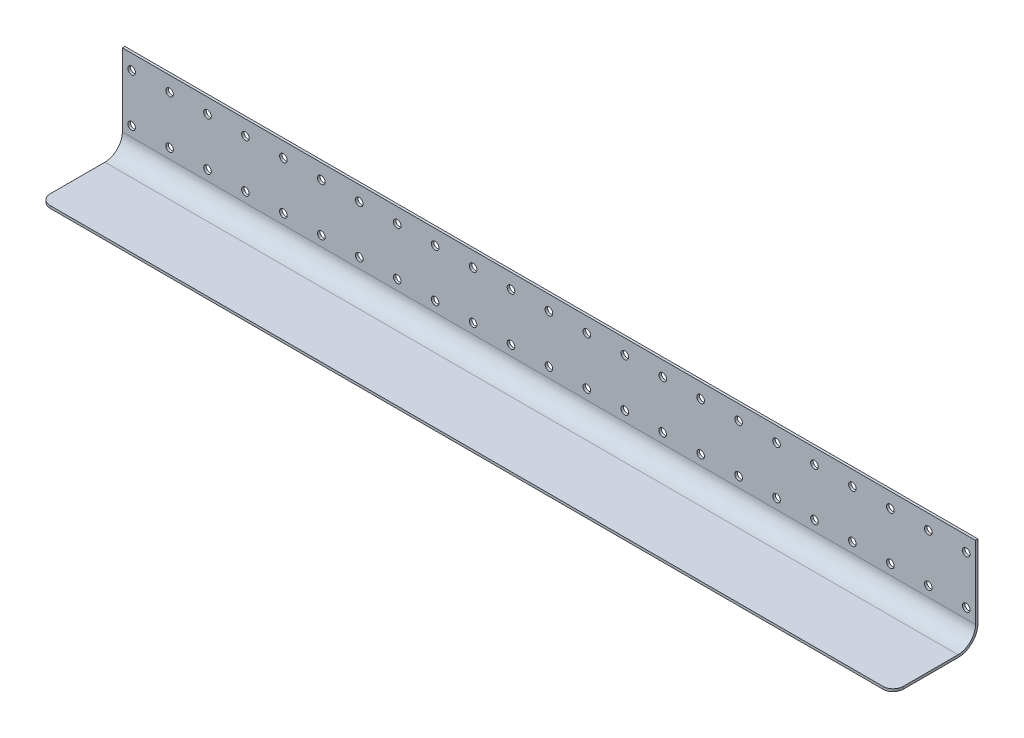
from build123d import *

# Parameters (mm, degrees)
MAIN_BODY_DEPTH         = 609.4222
UPPER_TABS_DEPTH        = 10
F_5DIA_HOLE_FOR_PART_R  = 4.826
HOLES_BOT_DEPTH         = 10
CUT_EXTRUDE1_DEPTH      = 641.320120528
CUT_EXTRUDE1_DEPTH_BACK = 641.320120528
SKETCH8_W               = 1304.722014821
SKETCH8_H               = 157.039912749
CUT_EXTRUDE2_DEPTH      = 623.697227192
CUT_EXTRUDE2_DEPTH_BACK = 623.697227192
SKETCH9_W               = 974.158692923
SKETCH9_H               = 1499.322432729
SKETCH9_W_2             = 364.808399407
SKETCH9_H_2             = 1085.35177788
FILLET1_R               = 13


with BuildPart() as part:
    # sk main body → main body (new, symmetric)
    with BuildSketch(Plane.YZ):
        with BuildLine():
            Line((49.53, 0), (-43.18, 0))
            ThreePointArc((-43.18, 0), (-61.140512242, 7.439487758), (-68.58, 25.4))
            Line((-68.58, 25.4), (-68.58, 158.75))
            ThreePointArc((-68.58, 158.75), (-61.140512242, 176.710512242), (-43.18, 184.15))
            Line((-43.18, 184.15), (-7.62, 184.15))
            Line((-7.62, 184.15), (-7.62, 180.975))
            Line((-7.62, 180.975), (-43.18, 180.975))
            ThreePointArc((-43.18, 180.975), (-58.895448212, 174.465448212), (-65.405, 158.75))
            Line((-65.405, 158.75), (-65.405, 25.4))
            ThreePointArc((-65.405, 25.4), (-58.895448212, 9.684551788), (-43.18, 3.175))
            Line((-43.18, 3.175), (49.53, 3.175))
            Line((49.53, 3.175), (49.53, 0))
        make_face()
    extrude(amount=MAIN_BODY_DEPTH, both=True)

    # Sketch6 → Upper tabs (cut)
    with BuildSketch(Plane.XY.offset(184.15)):
        Polygon((-371.496158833, -43.18), (-304.8, 72.341135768), (-238.103841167, -43.18), (238.103841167, -43.18), (304.8, 72.341135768), (371.496158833, -43.18), (645.161865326, -43.18), (645.161865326, 115.883053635), (-638.81273334, 115.883053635), (-638.81273334, -43.18), align=None)
    extrude(amount=-UPPER_TABS_DEPTH, mode=Mode.SUBTRACT)

    # 5dia hole for part → Holes Bot (cut)
    with BuildSketch(Plane(origin=(0, 0, 0), x_dir=(0, 1, 0), z_dir=(0, 0, 1))):
        with Locations((-30.48, -579.12)):
            Circle(F_5DIA_HOLE_FOR_PART_R)
        with Locations((30.48, -579.12)):
            Circle(F_5DIA_HOLE_FOR_PART_R)
        with Locations((-30.48, -530.86)):
            Circle(F_5DIA_HOLE_FOR_PART_R)
        with Locations((30.48, -530.86)):
            Circle(F_5DIA_HOLE_FOR_PART_R)
        with Locations((-30.48, -482.6)):
            Circle(F_5DIA_HOLE_FOR_PART_R)
        with Locations((30.48, -482.6)):
            Circle(F_5DIA_HOLE_FOR_PART_R)
        with Locations((-30.48, -434.34)):
            Circle(F_5DIA_HOLE_FOR_PART_R)
        with Locations((30.48, -434.34)):
            Circle(F_5DIA_HOLE_FOR_PART_R)
        with Locations((-30.48, -386.08)):
            Circle(F_5DIA_HOLE_FOR_PART_R)
        with Locations((30.48, -386.08)):
            Circle(F_5DIA_HOLE_FOR_PART_R)
        with Locations((-30.48, -337.82)):
            Circle(F_5DIA_HOLE_FOR_PART_R)
        with Locations((30.48, -337.82)):
            Circle(F_5DIA_HOLE_FOR_PART_R)
        with Locations((-30.48, -289.56)):
            Circle(F_5DIA_HOLE_FOR_PART_R)
        with Locations((30.48, -289.56)):
            Circle(F_5DIA_HOLE_FOR_PART_R)
        with Locations((-30.48, -241.3)):
            Circle(F_5DIA_HOLE_FOR_PART_R)
        with Locations((30.48, -241.3)):
            Circle(F_5DIA_HOLE_FOR_PART_R)
        with Locations((-30.48, -193.04)):
            Circle(F_5DIA_HOLE_FOR_PART_R)
        with Locations((30.48, -193.04)):
            Circle(F_5DIA_HOLE_FOR_PART_R)
        with Locations((-30.48, -144.78)):
            Circle(F_5DIA_HOLE_FOR_PART_R)
        with Locations((30.48, -144.78)):
            Circle(F_5DIA_HOLE_FOR_PART_R)
        with Locations((-30.48, -96.52)):
            Circle(F_5DIA_HOLE_FOR_PART_R)
        with Locations((30.48, -96.52)):
            Circle(F_5DIA_HOLE_FOR_PART_R)
        with Locations((-30.48, -48.26)):
            Circle(F_5DIA_HOLE_FOR_PART_R)
        with Locations((30.48, -48.26)):
            Circle(F_5DIA_HOLE_FOR_PART_R)
        with Locations((-30.48, 0)):
            Circle(F_5DIA_HOLE_FOR_PART_R)
        with Locations((30.48, 0)):
            Circle(F_5DIA_HOLE_FOR_PART_R)
        with Locations((-30.48, 48.26)):
            Circle(F_5DIA_HOLE_FOR_PART_R)
        with Locations((30.48, 48.26)):
            Circle(F_5DIA_HOLE_FOR_PART_R)
        with Locations((-30.48, 96.52)):
            Circle(F_5DIA_HOLE_FOR_PART_R)
        with Locations((30.48, 96.52)):
            Circle(F_5DIA_HOLE_FOR_PART_R)
        with Locations((-30.48, 144.78)):
            Circle(F_5DIA_HOLE_FOR_PART_R)
        with Locations((30.48, 144.78)):
            Circle(F_5DIA_HOLE_FOR_PART_R)
        with Locations((-30.48, 193.04)):
            Circle(F_5DIA_HOLE_FOR_PART_R)
        with Locations((30.48, 193.04)):
            Circle(F_5DIA_HOLE_FOR_PART_R)
        with Locations((-30.48, 241.3)):
            Circle(F_5DIA_HOLE_FOR_PART_R)
        with Locations((30.48, 241.3)):
            Circle(F_5DIA_HOLE_FOR_PART_R)
        with Locations((-30.48, 289.56)):
            Circle(F_5DIA_HOLE_FOR_PART_R)
        with Locations((30.48, 289.56)):
            Circle(F_5DIA_HOLE_FOR_PART_R)
        with Locations((-30.48, 337.82)):
            Circle(F_5DIA_HOLE_FOR_PART_R)
        with Locations((30.48, 337.82)):
            Circle(F_5DIA_HOLE_FOR_PART_R)
        with Locations((-30.48, 386.08)):
            Circle(F_5DIA_HOLE_FOR_PART_R)
        with Locations((30.48, 386.08)):
            Circle(F_5DIA_HOLE_FOR_PART_R)
        with Locations((-30.48, 434.34)):
            Circle(F_5DIA_HOLE_FOR_PART_R)
        with Locations((30.48, 434.34)):
            Circle(F_5DIA_HOLE_FOR_PART_R)
        with Locations((-30.48, 482.6)):
            Circle(F_5DIA_HOLE_FOR_PART_R)
        with Locations((30.48, 482.6)):
            Circle(F_5DIA_HOLE_FOR_PART_R)
        with Locations((-30.48, 530.86)):
            Circle(F_5DIA_HOLE_FOR_PART_R)
        with Locations((30.48, 530.86)):
            Circle(F_5DIA_HOLE_FOR_PART_R)
        with Locations((-30.48, 579.12)):
            Circle(F_5DIA_HOLE_FOR_PART_R)
        with Locations((30.48, 579.12)):
            Circle(F_5DIA_HOLE_FOR_PART_R)
    extrude(amount=HOLES_BOT_DEPTH, mode=Mode.SUBTRACT)

    # Sketch8 → Cut-Extrude1 (cut, two sides: drawn at the far end of the back side and taken through both)
    with BuildSketch(Plane(origin=(0, 0, 0), x_dir=(-1, 0, 0), z_dir=(0, 1, 0)).offset(-CUT_EXTRUDE1_DEPTH_BACK)):
        with Locations((-7.385463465, 186.469956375)):
            Rectangle(SKETCH8_W, SKETCH8_H)
    extrude(amount=CUT_EXTRUDE1_DEPTH + CUT_EXTRUDE1_DEPTH_BACK, mode=Mode.SUBTRACT)

    # Sketch9 → Cut-Extrude2 (cut, two sides: drawn at the far end of the back side and taken through both)
    with BuildSketch(Plane(origin=(0, 0, 0), x_dir=(0, 1, 0), z_dir=(0, 0, 1)).offset(-CUT_EXTRUDE2_DEPTH_BACK)):
        with Locations((4.952865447, -30.379971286)):
            Rectangle(SKETCH9_W, SKETCH9_H)
        with Locations((0.943981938, 0)):
            Rectangle(SKETCH9_W_2, SKETCH9_H_2, mode=Mode.SUBTRACT)
    extrude(amount=CUT_EXTRUDE2_DEPTH + CUT_EXTRUDE2_DEPTH_BACK, mode=Mode.SUBTRACT)

    # Fillet1
    fillet1_edges = [part.edges().sort_by_distance(p)[0] for p in [
        (542.67588894, -66.9925, 107.95),
        (-542.67588894, -66.9925, 107.95),
    ]]
    fillet(fillet1_edges, radius=FILLET1_R)


solid = part.part
